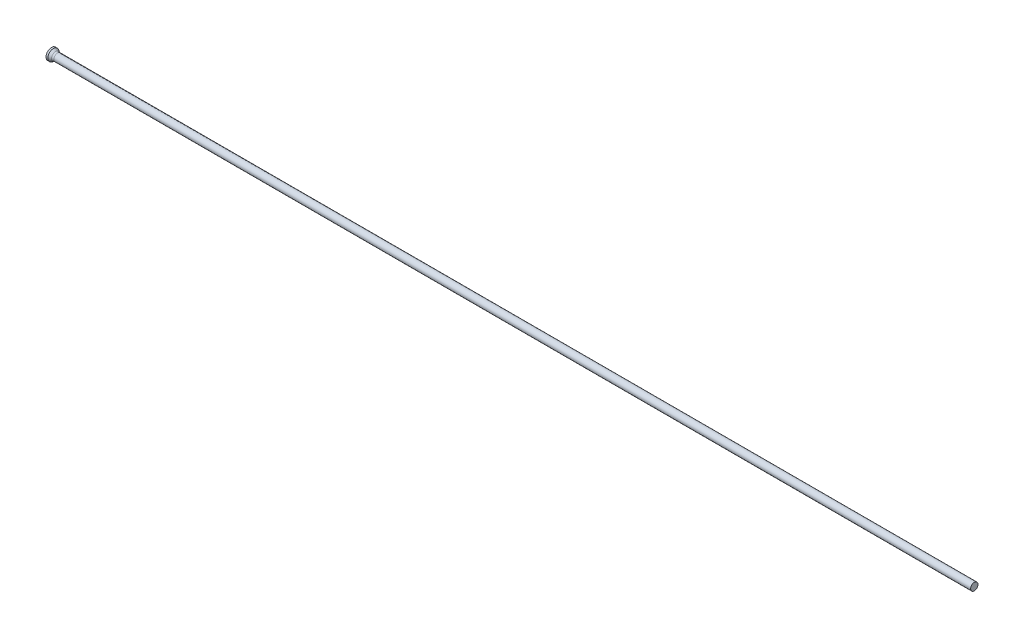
ISO-10303-21;
HEADER;
FILE_DESCRIPTION(('STEP AP214'),'2;1');
FILE_NAME('part.step','',(''),(''),'','','');
FILE_SCHEMA(('AUTOMOTIVE_DESIGN { 1 0 10303 214 1 1 1 1 }'));
ENDSEC;
DATA;
#1=APPLICATION_CONTEXT('core data for automotive mechanical design processes');
#2=APPLICATION_PROTOCOL_DEFINITION('international standard','automotive_design',2000,#1);
#3=PRODUCT_CONTEXT('',#1,'mechanical');
#4=PRODUCT('Part','Part','',(#3));
#5=PRODUCT_RELATED_PRODUCT_CATEGORY('part','',(#4));
#6=PRODUCT_DEFINITION_FORMATION('','',#4);
#7=PRODUCT_DEFINITION_CONTEXT('part definition',#1,'design');
#8=PRODUCT_DEFINITION('design','',#6,#7);
#9=PRODUCT_DEFINITION_SHAPE('','',#8);
#10=(LENGTH_UNIT() NAMED_UNIT(*) SI_UNIT(.MILLI.,.METRE.));
#11=(NAMED_UNIT(*) PLANE_ANGLE_UNIT() SI_UNIT($,.RADIAN.));
#12=(NAMED_UNIT(*) SI_UNIT($,.STERADIAN.) SOLID_ANGLE_UNIT());
#13=UNCERTAINTY_MEASURE_WITH_UNIT(LENGTH_MEASURE(1.E-05),#10,'distance_accuracy_value','');
#14=(GEOMETRIC_REPRESENTATION_CONTEXT(3) GLOBAL_UNCERTAINTY_ASSIGNED_CONTEXT((#13)) GLOBAL_UNIT_ASSIGNED_CONTEXT((#10,
#11,#12)) REPRESENTATION_CONTEXT('',''));
#15=CARTESIAN_POINT('',(0.,0.,0.));
#16=DIRECTION('',(0.,0.,1.));
#17=DIRECTION('',(1.,0.,0.));
#18=AXIS2_PLACEMENT_3D('',#15,#16,#17);
#19=CARTESIAN_POINT('',(0.,0.,0.));
#20=DIRECTION('',(1.,0.,0.));
#21=DIRECTION('',(0.,0.,-1.));
#22=AXIS2_PLACEMENT_3D('',#19,#20,#21);
#23=PLANE('',#22);
#24=CARTESIAN_POINT('',(0.,0.,0.));
#25=DIRECTION('',(-1.,0.,0.));
#26=DIRECTION('',(0.,0.,1.));
#27=AXIS2_PLACEMENT_3D('',#24,#25,#26);
#28=CIRCLE('',#27,1.5);
#29=CARTESIAN_POINT('',(0.,0.,1.5));
#30=VERTEX_POINT('',#29);
#31=EDGE_CURVE('E25',#30,#30,#28,.T.);
#32=ORIENTED_EDGE('',*,*,#31,.T.);
#33=EDGE_LOOP('',(#32));
#34=FACE_BOUND('',#33,.T.);
#35=ADVANCED_FACE('F14',(#34),#23,.F.);
#36=CARTESIAN_POINT('',(0.,0.,0.));
#37=DIRECTION('',(-1.,0.,0.));
#38=DIRECTION('',(0.,0.,1.));
#39=AXIS2_PLACEMENT_3D('',#36,#37,#38);
#40=CYLINDRICAL_SURFACE('',#39,1.5);
#41=ORIENTED_EDGE('',*,*,#31,.F.);
#42=EDGE_LOOP('',(#41));
#43=FACE_BOUND('',#42,.T.);
#44=CARTESIAN_POINT('',(0.503974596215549,0.,0.));
#45=DIRECTION('',(-1.,0.,0.));
#46=DIRECTION('',(0.,0.,1.));
#47=AXIS2_PLACEMENT_3D('',#44,#45,#46);
#48=CIRCLE('',#47,1.5);
#49=CARTESIAN_POINT('',(0.503974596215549,0.,1.5));
#50=VERTEX_POINT('',#49);
#51=EDGE_CURVE('E29',#50,#50,#48,.T.);
#52=ORIENTED_EDGE('',*,*,#51,.T.);
#53=EDGE_LOOP('',(#52));
#54=FACE_BOUND('',#53,.T.);
#55=ADVANCED_FACE('F53',(#43,#54),#40,.T.);
#56=CARTESIAN_POINT('',(1.37,0.,0.));
#57=DIRECTION('',(-1.,0.,0.));
#58=DIRECTION('',(0.,0.,1.));
#59=AXIS2_PLACEMENT_3D('',#56,#57,#58);
#60=CONICAL_SURFACE('',#59,1.,0.523598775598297);
#61=CARTESIAN_POINT('',(1.13794919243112,0.,0.));
#62=DIRECTION('',(-1.,0.,0.));
#63=DIRECTION('',(0.,0.,1.));
#64=AXIS2_PLACEMENT_3D('',#61,#62,#63);
#65=CIRCLE('',#64,1.13397459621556);
#66=CARTESIAN_POINT('',(1.13794919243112,0.,1.13397459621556));
#67=VERTEX_POINT('',#66);
#68=EDGE_CURVE('E21',#67,#67,#65,.T.);
#69=ORIENTED_EDGE('',*,*,#68,.T.);
#70=EDGE_LOOP('',(#69));
#71=FACE_BOUND('',#70,.T.);
#72=ORIENTED_EDGE('',*,*,#51,.F.);
#73=EDGE_LOOP('',(#72));
#74=FACE_BOUND('',#73,.T.);
#75=ADVANCED_FACE('F50',(#71,#74),#60,.T.);
#76=CARTESIAN_POINT('',(0.,0.,0.));
#77=DIRECTION('',(-1.,0.,0.));
#78=DIRECTION('',(0.,0.,1.));
#79=AXIS2_PLACEMENT_3D('',#76,#77,#78);
#80=CYLINDRICAL_SURFACE('',#79,1.);
#81=CARTESIAN_POINT('',(1.63794919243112,0.,0.));
#82=DIRECTION('',(-1.,0.,0.));
#83=DIRECTION('',(0.,0.,1.));
#84=AXIS2_PLACEMENT_3D('',#81,#82,#83);
#85=CIRCLE('',#84,1.);
#86=CARTESIAN_POINT('',(1.63794919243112,0.,1.));
#87=VERTEX_POINT('',#86);
#88=EDGE_CURVE('E9',#87,#87,#85,.F.);
#89=ORIENTED_EDGE('',*,*,#88,.T.);
#90=EDGE_LOOP('',(#89));
#91=FACE_BOUND('',#90,.T.);
#92=CARTESIAN_POINT('',(250.,0.,0.));
#93=DIRECTION('',(-1.,0.,0.));
#94=DIRECTION('',(0.,0.,1.));
#95=AXIS2_PLACEMENT_3D('',#92,#93,#94);
#96=CIRCLE('',#95,1.);
#97=CARTESIAN_POINT('',(250.,0.,1.));
#98=VERTEX_POINT('',#97);
#99=EDGE_CURVE('E34',#98,#98,#96,.T.);
#100=ORIENTED_EDGE('',*,*,#99,.T.);
#101=EDGE_LOOP('',(#100));
#102=FACE_BOUND('',#101,.T.);
#103=ADVANCED_FACE('F38',(#91,#102),#80,.T.);
#104=CARTESIAN_POINT('',(250.,1.,0.));
#105=DIRECTION('',(-1.,0.,0.));
#106=DIRECTION('',(0.,0.,1.));
#107=AXIS2_PLACEMENT_3D('',#104,#105,#106);
#108=PLANE('',#107);
#109=ORIENTED_EDGE('',*,*,#99,.F.);
#110=EDGE_LOOP('',(#109));
#111=FACE_BOUND('',#110,.T.);
#112=ADVANCED_FACE('F40',(#111),#108,.F.);
#113=CARTESIAN_POINT('',(1.63794919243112,0.,0.));
#114=DIRECTION('',(-1.,0.,0.));
#115=DIRECTION('',(0.,0.,1.));
#116=AXIS2_PLACEMENT_3D('',#113,#114,#115);
#117=TOROIDAL_SURFACE('',#116,2.,1.);
#118=ORIENTED_EDGE('',*,*,#88,.F.);
#119=EDGE_LOOP('',(#118));
#120=FACE_BOUND('',#119,.T.);
#121=ORIENTED_EDGE('',*,*,#68,.F.);
#122=EDGE_LOOP('',(#121));
#123=FACE_BOUND('',#122,.T.);
#124=ADVANCED_FACE('F16',(#120,#123),#117,.F.);
#125=CLOSED_SHELL('',(#35,#55,#75,#103,#112,#124));
#126=MANIFOLD_SOLID_BREP('B1',#125);
#127=ADVANCED_BREP_SHAPE_REPRESENTATION('',(#18,#126),#14);
#128=SHAPE_DEFINITION_REPRESENTATION(#9,#127);
ENDSEC;
END-ISO-10303-21;
